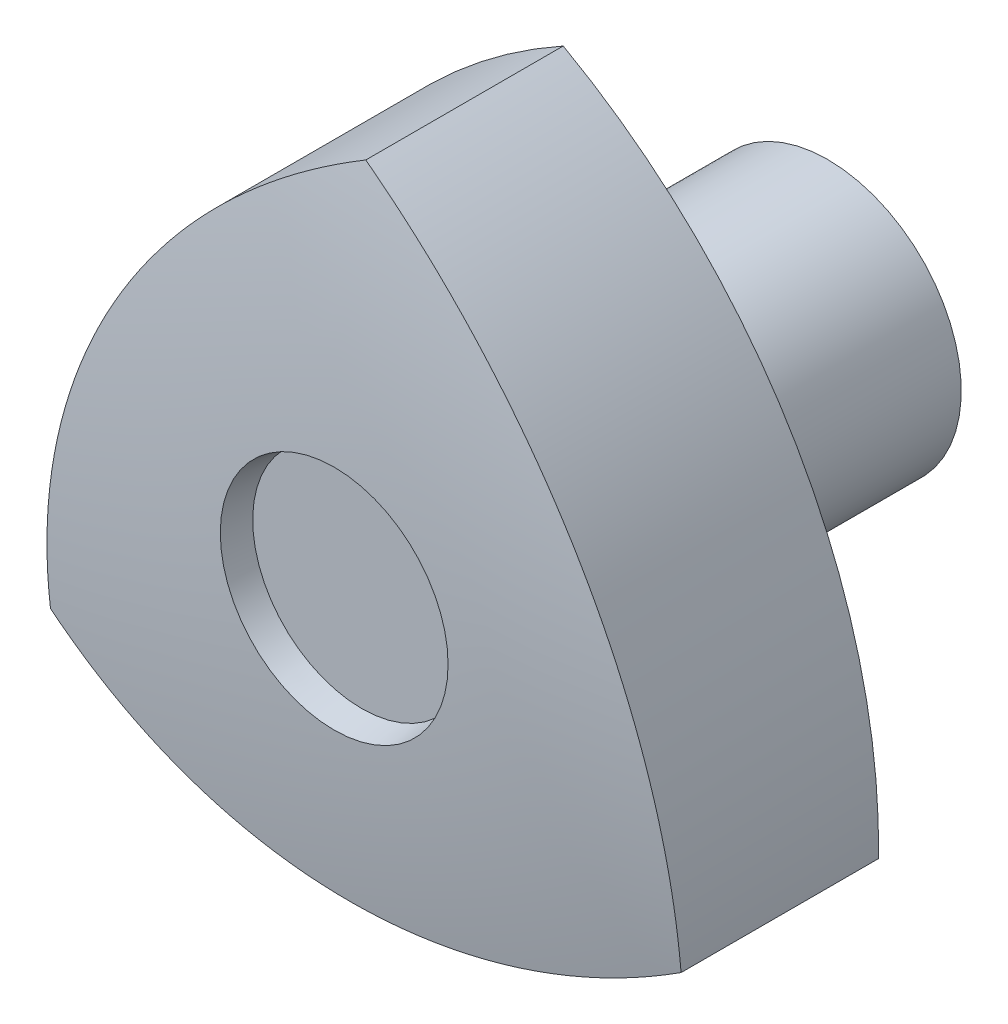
ISO-10303-21;
HEADER;
FILE_DESCRIPTION(('STEP AP214'),'2;1');
FILE_NAME('part.step','',(''),(''),'','','');
FILE_SCHEMA(('AUTOMOTIVE_DESIGN { 1 0 10303 214 1 1 1 1 }'));
ENDSEC;
DATA;
#1=APPLICATION_CONTEXT('core data for automotive mechanical design processes');
#2=APPLICATION_PROTOCOL_DEFINITION('international standard','automotive_design',2000,#1);
#3=PRODUCT_CONTEXT('',#1,'mechanical');
#4=PRODUCT('Part','Part','',(#3));
#5=PRODUCT_RELATED_PRODUCT_CATEGORY('part','',(#4));
#6=PRODUCT_DEFINITION_FORMATION('','',#4);
#7=PRODUCT_DEFINITION_CONTEXT('part definition',#1,'design');
#8=PRODUCT_DEFINITION('design','',#6,#7);
#9=PRODUCT_DEFINITION_SHAPE('','',#8);
#10=(LENGTH_UNIT() NAMED_UNIT(*) SI_UNIT(.MILLI.,.METRE.));
#11=(NAMED_UNIT(*) PLANE_ANGLE_UNIT() SI_UNIT($,.RADIAN.));
#12=(NAMED_UNIT(*) SI_UNIT($,.STERADIAN.) SOLID_ANGLE_UNIT());
#13=UNCERTAINTY_MEASURE_WITH_UNIT(LENGTH_MEASURE(1.E-05),#10,'distance_accuracy_value','');
#14=(GEOMETRIC_REPRESENTATION_CONTEXT(3) GLOBAL_UNCERTAINTY_ASSIGNED_CONTEXT((#13)) GLOBAL_UNIT_ASSIGNED_CONTEXT((#10,
#11,#12)) REPRESENTATION_CONTEXT('',''));
#15=CARTESIAN_POINT('',(0.,0.,0.));
#16=DIRECTION('',(0.,0.,1.));
#17=DIRECTION('',(1.,0.,0.));
#18=AXIS2_PLACEMENT_3D('',#15,#16,#17);
#19=CARTESIAN_POINT('',(0.,-4.99999999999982,0.));
#20=DIRECTION('',(0.,0.,1.));
#21=DIRECTION('',(0.,-1.,0.));
#22=AXIS2_PLACEMENT_3D('',#19,#20,#21);
#23=PLANE('',#22);
#24=CARTESIAN_POINT('',(0.,0.,0.));
#25=DIRECTION('',(0.,0.,-1.));
#26=DIRECTION('',(0.,1.,0.));
#27=AXIS2_PLACEMENT_3D('',#24,#25,#26);
#28=CIRCLE('',#27,5.);
#29=CARTESIAN_POINT('',(0.,5.,0.));
#30=VERTEX_POINT('',#29);
#31=EDGE_CURVE('E126',#30,#30,#28,.T.);
#32=ORIENTED_EDGE('',*,*,#31,.F.);
#33=EDGE_LOOP('',(#32));
#34=FACE_BOUND('',#33,.T.);
#35=CARTESIAN_POINT('',(0.,0.,0.));
#36=DIRECTION('',(0.,0.,-1.));
#37=DIRECTION('',(0.,1.,0.));
#38=AXIS2_PLACEMENT_3D('',#35,#36,#37);
#39=CIRCLE('',#38,6.49999999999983);
#40=CARTESIAN_POINT('',(0.,6.49999999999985,0.));
#41=VERTEX_POINT('',#40);
#42=EDGE_CURVE('E117',#41,#41,#39,.F.);
#43=ORIENTED_EDGE('',*,*,#42,.F.);
#44=EDGE_LOOP('',(#43));
#45=FACE_BOUND('',#44,.T.);
#46=ADVANCED_FACE('F14',(#34,#45),#23,.F.);
#47=CARTESIAN_POINT('',(0.,0.,38.6));
#48=DIRECTION('',(0.,0.,-1.));
#49=DIRECTION('',(0.,1.,0.));
#50=AXIS2_PLACEMENT_3D('',#47,#48,#49);
#51=CYLINDRICAL_SURFACE('',#50,6.49999999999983);
#52=ORIENTED_EDGE('',*,*,#42,.T.);
#53=EDGE_LOOP('',(#52));
#54=FACE_BOUND('',#53,.T.);
#55=CARTESIAN_POINT('',(0.,0.,0.200000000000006));
#56=DIRECTION('',(0.,0.,-1.));
#57=DIRECTION('',(0.,1.,0.));
#58=AXIS2_PLACEMENT_3D('',#55,#56,#57);
#59=CIRCLE('',#58,6.49999999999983);
#60=CARTESIAN_POINT('',(0.,6.49999999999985,0.200000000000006));
#61=VERTEX_POINT('',#60);
#62=EDGE_CURVE('E115',#61,#61,#59,.T.);
#63=ORIENTED_EDGE('',*,*,#62,.T.);
#64=EDGE_LOOP('',(#63));
#65=FACE_BOUND('',#64,.T.);
#66=ADVANCED_FACE('F166',(#54,#65),#51,.T.);
#67=CARTESIAN_POINT('',(0.,-6.49999999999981,0.199999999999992));
#68=DIRECTION('',(0.,0.,1.));
#69=DIRECTION('',(0.,-1.,0.));
#70=AXIS2_PLACEMENT_3D('',#67,#68,#69);
#71=PLANE('',#70);
#72=ORIENTED_EDGE('',*,*,#62,.F.);
#73=EDGE_LOOP('',(#72));
#74=FACE_BOUND('',#73,.T.);
#75=CARTESIAN_POINT('',(0.,0.,0.199999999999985));
#76=DIRECTION('',(0.,0.,-1.));
#77=DIRECTION('',(0.,1.,0.));
#78=AXIS2_PLACEMENT_3D('',#75,#76,#77);
#79=CIRCLE('',#78,11.);
#80=CARTESIAN_POINT('',(0.,11.,0.199999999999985));
#81=VERTEX_POINT('',#80);
#82=EDGE_CURVE('E112',#81,#81,#79,.F.);
#83=ORIENTED_EDGE('',*,*,#82,.F.);
#84=EDGE_LOOP('',(#83));
#85=FACE_BOUND('',#84,.T.);
#86=ADVANCED_FACE('F159',(#74,#85),#71,.F.);
#87=CARTESIAN_POINT('',(0.,0.,38.6));
#88=DIRECTION('',(0.,0.,-1.));
#89=DIRECTION('',(0.,1.,0.));
#90=AXIS2_PLACEMENT_3D('',#87,#88,#89);
#91=CYLINDRICAL_SURFACE('',#90,11.);
#92=ORIENTED_EDGE('',*,*,#82,.T.);
#93=EDGE_LOOP('',(#92));
#94=FACE_BOUND('',#93,.T.);
#95=CARTESIAN_POINT('',(0.,0.,22.));
#96=DIRECTION('',(0.,0.,-1.));
#97=DIRECTION('',(0.,1.,0.));
#98=AXIS2_PLACEMENT_3D('',#95,#96,#97);
#99=CIRCLE('',#98,11.);
#100=CARTESIAN_POINT('',(0.,11.,22.));
#101=VERTEX_POINT('',#100);
#102=EDGE_CURVE('E58',#101,#101,#99,.T.);
#103=ORIENTED_EDGE('',*,*,#102,.T.);
#104=EDGE_LOOP('',(#103));
#105=FACE_BOUND('',#104,.T.);
#106=ADVANCED_FACE('F154',(#94,#105),#91,.T.);
#107=CARTESIAN_POINT('',(0.,-11.,22.));
#108=DIRECTION('',(0.,0.,1.));
#109=DIRECTION('',(0.,-1.,0.));
#110=AXIS2_PLACEMENT_3D('',#107,#108,#109);
#111=PLANE('',#110);
#112=ORIENTED_EDGE('',*,*,#102,.F.);
#113=EDGE_LOOP('',(#112));
#114=FACE_BOUND('',#113,.T.);
#115=CARTESIAN_POINT('',(24.4868682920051,-14.1375,21.9999999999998));
#116=DIRECTION('',(0.,0.,1.));
#117=DIRECTION('',(-1.,0.,0.));
#118=AXIS2_PLACEMENT_3D('',#115,#116,#117);
#119=CIRCLE('',#118,50.475);
#120=CARTESIAN_POINT('',(-1.43982048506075E-13,30.,22.));
#121=VERTEX_POINT('',#120);
#122=CARTESIAN_POINT('',(-25.9807621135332,-14.9999999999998,22.));
#123=VERTEX_POINT('',#122);
#124=EDGE_CURVE('E62',#121,#123,#119,.T.);
#125=ORIENTED_EDGE('',*,*,#124,.F.);
#126=CARTESIAN_POINT('',(-24.486868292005,-14.1375,22.));
#127=DIRECTION('',(0.,0.,1.));
#128=DIRECTION('',(-1.,0.,0.));
#129=AXIS2_PLACEMENT_3D('',#126,#127,#128);
#130=CIRCLE('',#129,50.475);
#131=CARTESIAN_POINT('',(25.9807621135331,-15.0000000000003,22.));
#132=VERTEX_POINT('',#131);
#133=EDGE_CURVE('E60',#132,#121,#130,.T.);
#134=ORIENTED_EDGE('',*,*,#133,.F.);
#135=CARTESIAN_POINT('',(0.,28.275,22.));
#136=DIRECTION('',(0.,0.,1.));
#137=DIRECTION('',(-1.,0.,0.));
#138=AXIS2_PLACEMENT_3D('',#135,#136,#137);
#139=CIRCLE('',#138,50.475);
#140=EDGE_CURVE('E49',#123,#132,#139,.T.);
#141=ORIENTED_EDGE('',*,*,#140,.F.);
#142=EDGE_LOOP('',(#125,#134,#141));
#143=FACE_BOUND('',#142,.T.);
#144=ADVANCED_FACE('F61',(#114,#143),#111,.F.);
#145=CARTESIAN_POINT('',(0.,-8.98498976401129,38.6));
#146=DIRECTION('',(0.,0.,-1.));
#147=DIRECTION('',(0.,1.,0.));
#148=AXIS2_PLACEMENT_3D('',#145,#146,#147);
#149=PLANE('',#148);
#150=CARTESIAN_POINT('',(0.,0.,38.6));
#151=DIRECTION('',(0.,0.,1.));
#152=DIRECTION('',(0.,-1.,0.));
#153=AXIS2_PLACEMENT_3D('',#150,#151,#152);
#154=CIRCLE('',#153,8.98498976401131);
#155=CARTESIAN_POINT('',(0.,-8.98498976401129,38.6));
#156=VERTEX_POINT('',#155);
#157=EDGE_CURVE('E106',#156,#156,#154,.T.);
#158=ORIENTED_EDGE('',*,*,#157,.T.);
#159=EDGE_LOOP('',(#158));
#160=FACE_BOUND('',#159,.T.);
#161=ADVANCED_FACE('F98',(#160),#149,.F.);
#162=CARTESIAN_POINT('',(0.,28.275,60.));
#163=DIRECTION('',(0.,0.,1.));
#164=DIRECTION('',(-1.,0.,0.));
#165=AXIS2_PLACEMENT_3D('',#162,#163,#164);
#166=CYLINDRICAL_SURFACE('',#165,50.475);
#167=CARTESIAN_POINT('',(-25.9807621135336,-15.,38.2666666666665));
#168=CARTESIAN_POINT('',(-25.4333646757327,-15.3286377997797,38.3303674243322));
#169=CARTESIAN_POINT('',(-24.8796016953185,-15.6469655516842,38.3919197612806));
#170=CARTESIAN_POINT('',(-23.7600350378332,-16.2625632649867,38.5106833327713));
#171=CARTESIAN_POINT('',(-23.1942313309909,-16.5598331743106,38.5678945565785));
#172=CARTESIAN_POINT('',(-21.4800854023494,-17.4192535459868,38.7329221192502));
#173=CARTESIAN_POINT('',(-20.314733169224,-17.949179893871,38.8341643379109));
#174=CARTESIAN_POINT('',(-17.9460386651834,-18.9193184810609,39.0187399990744));
#175=CARTESIAN_POINT('',(-16.7426967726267,-19.3595316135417,39.1020736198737));
#176=CARTESIAN_POINT('',(-14.3049330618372,-20.1474680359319,39.2506711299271));
#177=CARTESIAN_POINT('',(-13.0705096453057,-20.4951865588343,39.3159340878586));
#178=CARTESIAN_POINT('',(-10.4610806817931,-21.1239590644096,39.4335816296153));
#179=CARTESIAN_POINT('',(-9.08374319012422,-21.3957097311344,39.4841857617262));
#180=CARTESIAN_POINT('',(-6.31052709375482,-21.8236189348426,39.5636971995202));
#181=CARTESIAN_POINT('',(-4.91464705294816,-21.9797684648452,39.5926028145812));
#182=CARTESIAN_POINT('',(-2.11416082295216,-22.1752381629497,39.6287660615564));
#183=CARTESIAN_POINT('',(-0.709552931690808,-22.2145347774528,39.6360193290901));
#184=CARTESIAN_POINT('',(2.09792344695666,-22.1759176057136,39.6288830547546));
#185=CARTESIAN_POINT('',(3.50079202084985,-22.0980099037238,39.6144946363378));
#186=CARTESIAN_POINT('',(6.28771921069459,-21.8263032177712,39.5641714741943));
#187=CARTESIAN_POINT('',(7.67183699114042,-21.6330902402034,39.5283456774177));
#188=CARTESIAN_POINT('',(10.4187751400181,-21.1327305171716,39.4351850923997));
#189=CARTESIAN_POINT('',(11.7815929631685,-20.8255702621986,39.3778477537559));
#190=CARTESIAN_POINT('',(14.4745364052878,-20.1001609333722,39.241761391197));
#191=CARTESIAN_POINT('',(15.8046966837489,-19.6820357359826,39.1630362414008));
#192=CARTESIAN_POINT('',(18.4242372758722,-18.7378678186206,38.9843019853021));
#193=CARTESIAN_POINT('',(19.7136361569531,-18.2118750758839,38.8843027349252));
#194=CARTESIAN_POINT('',(21.4075776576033,-17.4378499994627,38.7363291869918));
#195=CARTESIAN_POINT('',(21.8342926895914,-17.235573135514,38.697594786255));
#196=CARTESIAN_POINT('',(22.6816334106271,-16.8192546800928,38.6177315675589));
#197=CARTESIAN_POINT('',(23.1022604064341,-16.6052156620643,38.5766032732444));
#198=CARTESIAN_POINT('',(23.9363879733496,-16.1659355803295,38.4920437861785));
#199=CARTESIAN_POINT('',(24.3499001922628,-15.9407157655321,38.448616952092));
#200=CARTESIAN_POINT('',(25.1703585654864,-15.4788612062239,38.3594040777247));
#201=CARTESIAN_POINT('',(25.5773033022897,-15.2422240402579,38.3136175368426));
#202=CARTESIAN_POINT('',(25.980762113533,-15.0000000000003,38.2666666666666));
#203=B_SPLINE_CURVE_WITH_KNOTS('',3,(#167,#168,#169,#170,#171,#172,#173,#174,#175,#176,#177,
#178,#179,#180,#181,#182,#183,#184,#185,#186,#187,#188,#189,#190,#191,#192,#193,#194,#195,#196,
#197,#198,#199,#200,#201,#202),.UNSPECIFIED.,.F.,.F.,(4,2,2,2,2,2,2,2,2,2,2,2,2,2,2,2,2,4),(0.,
1.92468080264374,3.8493663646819,7.69777230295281,11.5461399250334,15.3947058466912,
19.6039988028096,23.8136196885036,28.0240890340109,32.2343398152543,36.4233732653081,
40.6129035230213,44.7977763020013,48.9807145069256,50.402040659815,51.8230570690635,
53.241469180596,54.6601834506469),.UNSPECIFIED.);
#204=CARTESIAN_POINT('',(-25.9807621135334,-14.9999999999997,38.2666666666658));
#205=VERTEX_POINT('',#204);
#206=CARTESIAN_POINT('',(25.9807621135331,-15.0000000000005,38.2666666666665));
#207=VERTEX_POINT('',#206);
#208=EDGE_CURVE('E100',#205,#207,#203,.T.);
#209=ORIENTED_EDGE('',*,*,#208,.F.);
#210=DIRECTION('',(0.,0.,1.));
#211=VECTOR('',#210,1.);
#212=CARTESIAN_POINT('',(-25.9807621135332,-14.9999999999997,60.));
#213=LINE('',#212,#211);
#214=EDGE_CURVE('E56',#123,#205,#213,.T.);
#215=ORIENTED_EDGE('',*,*,#214,.F.);
#216=ORIENTED_EDGE('',*,*,#140,.T.);
#217=DIRECTION('',(0.,0.,1.));
#218=VECTOR('',#217,1.);
#219=CARTESIAN_POINT('',(25.9807621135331,-15.0000000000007,60.));
#220=LINE('',#219,#218);
#221=EDGE_CURVE('E54',#207,#132,#220,.F.);
#222=ORIENTED_EDGE('',*,*,#221,.F.);
#223=EDGE_LOOP('',(#209,#215,#216,#222));
#224=FACE_BOUND('',#223,.T.);
#225=ADVANCED_FACE('F52',(#224),#166,.T.);
#226=CARTESIAN_POINT('',(-24.486868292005,-14.1375000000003,60.));
#227=DIRECTION('',(0.,0.,1.));
#228=DIRECTION('',(-1.,0.,0.));
#229=AXIS2_PLACEMENT_3D('',#226,#227,#228);
#230=CYLINDRICAL_SURFACE('',#229,50.475);
#231=ORIENTED_EDGE('',*,*,#221,.T.);
#232=ORIENTED_EDGE('',*,*,#133,.T.);
#233=DIRECTION('',(0.,0.,1.));
#234=VECTOR('',#233,1.);
#235=CARTESIAN_POINT('',(-2.32452945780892E-13,29.9999999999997,60.));
#236=LINE('',#235,#234);
#237=CARTESIAN_POINT('',(-3.47211615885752E-13,30.,38.2666666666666));
#238=VERTEX_POINT('',#237);
#239=EDGE_CURVE('E34',#238,#121,#236,.F.);
#240=ORIENTED_EDGE('',*,*,#239,.F.);
#241=CARTESIAN_POINT('',(25.9807621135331,-15.0000000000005,38.2666666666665));
#242=CARTESIAN_POINT('',(25.9916720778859,-14.3616210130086,38.3303674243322));
#243=CARTESIAN_POINT('',(25.9904705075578,-13.7228843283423,38.3919197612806));
#244=CARTESIAN_POINT('',(25.9638104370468,-12.4455123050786,38.5106833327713));
#245=CARTESIAN_POINT('',(25.9383518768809,-11.8068769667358,38.5678945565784));
#246=CARTESIAN_POINT('',(25.8255587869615,-9.89267286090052,38.7329221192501));
#247=CARTESIAN_POINT('',(25.7018123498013,-8.61848504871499,38.8341643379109));
#248=CARTESIAN_POINT('',(25.3576297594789,-6.08206614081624,39.0187399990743));
#249=CARTESIAN_POINT('',(25.1371945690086,-4.81983492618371,39.1020736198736));
#250=CARTESIAN_POINT('',(24.6006856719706,-2.31470141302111,39.250671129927));
#251=CARTESIAN_POINT('',(24.2846070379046,-1.07180011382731,39.3159340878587));
#252=CARTESIAN_POINT('',(23.5244255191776,1.50241791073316,39.4335816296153));
#253=CARTESIAN_POINT('',(23.0710997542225,2.83110250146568,39.4841857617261));
#254=CARTESIAN_POINT('',(22.0550719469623,5.44673269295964,39.5636971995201));
#255=CARTESIAN_POINT('',(21.4923613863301,6.73367503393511,39.5926028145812));
#256=CARTESIAN_POINT('',(20.2613999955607,9.25670210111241,39.6287660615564));
#257=CARTESIAN_POINT('',(19.5931279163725,10.4927765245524,39.6360193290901));
#258=CARTESIAN_POINT('',(18.1559462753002,12.9048138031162,39.6288830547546));
#259=CARTESIAN_POINT('',(17.3870419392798,14.0807797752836,39.6144946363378));
#260=CARTESIAN_POINT('',(15.7582734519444,16.3584761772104,39.5641714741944));
#261=CARTESIAN_POINT('',(14.8988872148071,17.4605508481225,39.5283456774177));
#262=CARTESIAN_POINT('',(13.0920939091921,19.5892892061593,39.4351850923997));
#263=CARTESIAN_POINT('',(12.1446764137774,20.6159439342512,39.377847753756));
#264=CARTESIAN_POINT('',(10.1699817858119,22.585396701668,39.241761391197));
#265=CARTESIAN_POINT('',(9.14279460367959,23.5282866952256,39.1630362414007));
#266=CARTESIAN_POINT('',(7.01535090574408,25.3247914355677,38.9843019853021));
#267=CARTESIAN_POINT('',(5.91512838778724,26.1784472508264,38.8843027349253));
#268=CARTESIAN_POINT('',(4.39783225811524,27.2584310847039,38.7363291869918));
#269=CARTESIAN_POINT('',(4.00929783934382,27.5268387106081,38.697594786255));
#270=CARTESIAN_POINT('',(3.22508512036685,28.0524980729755,38.6177315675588));
#271=CARTESIAN_POINT('',(2.82940839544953,28.3097522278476,38.5766032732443));
#272=CARTESIAN_POINT('',(2.03191690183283,28.812487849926,38.4920437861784));
#273=CARTESIAN_POINT('',(1.63011471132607,29.0579900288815,38.448616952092));
#274=CARTESIAN_POINT('',(0.819907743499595,29.5376005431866,38.3594040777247));
#275=CARTESIAN_POINT('',(0.411501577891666,29.7717064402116,38.3136175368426));
#276=CARTESIAN_POINT('',(-5.37901856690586E-13,30.,38.2666666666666));
#277=B_SPLINE_CURVE_WITH_KNOTS('',3,(#241,#242,#243,#244,#245,#246,#247,#248,#249,#250,#251,
#252,#253,#254,#255,#256,#257,#258,#259,#260,#261,#262,#263,#264,#265,#266,#267,#268,#269,#270,
#271,#272,#273,#274,#275,#276),.UNSPECIFIED.,.F.,.F.,(4,2,2,2,2,2,2,2,2,2,2,2,2,2,2,2,2,4),(0.,
1.92468080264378,3.84936636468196,7.69777230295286,11.5461399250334,15.3947058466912,
19.6039988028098,23.8136196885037,28.024089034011,32.2343398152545,36.4233732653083,
40.6129035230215,44.7977763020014,48.9807145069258,50.4020406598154,51.823057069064,
53.2414691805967,54.6601834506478),.UNSPECIFIED.);
#278=EDGE_CURVE('E66',#207,#238,#277,.T.);
#279=ORIENTED_EDGE('',*,*,#278,.F.);
#280=EDGE_LOOP('',(#231,#232,#240,#279));
#281=FACE_BOUND('',#280,.T.);
#282=ADVANCED_FACE('F64',(#281),#230,.T.);
#283=CARTESIAN_POINT('',(24.4868682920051,-14.1375000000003,60.));
#284=DIRECTION('',(0.,0.,1.));
#285=DIRECTION('',(-1.,0.,0.));
#286=AXIS2_PLACEMENT_3D('',#283,#284,#285);
#287=CYLINDRICAL_SURFACE('',#286,50.475);
#288=ORIENTED_EDGE('',*,*,#239,.T.);
#289=ORIENTED_EDGE('',*,*,#124,.T.);
#290=ORIENTED_EDGE('',*,*,#214,.T.);
#291=CARTESIAN_POINT('',(-4.61208800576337E-13,29.9999999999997,38.2666666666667));
#292=CARTESIAN_POINT('',(-0.558307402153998,29.6902588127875,38.3303674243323));
#293=CARTESIAN_POINT('',(-1.11086881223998,29.3698498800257,38.3919197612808));
#294=CARTESIAN_POINT('',(-2.20377539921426,28.7080755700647,38.5106833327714));
#295=CARTESIAN_POINT('',(-2.7441205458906,28.3667101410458,38.5678945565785));
#296=CARTESIAN_POINT('',(-4.34547338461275,27.3119264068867,38.7329221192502));
#297=CARTESIAN_POINT('',(-5.38707918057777,26.5676649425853,38.834164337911));
#298=CARTESIAN_POINT('',(-7.41159109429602,25.0013846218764,39.0187399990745));
#299=CARTESIAN_POINT('',(-8.39449779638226,24.1793665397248,39.1020736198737));
#300=CARTESIAN_POINT('',(-10.2957526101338,22.4621694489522,39.2506711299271));
#301=CARTESIAN_POINT('',(-11.2140973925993,21.5669866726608,39.3159340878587));
#302=CARTESIAN_POINT('',(-13.063344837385,19.6215411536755,39.4335816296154));
#303=CARTESIAN_POINT('',(-13.9873565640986,18.564607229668,39.4841857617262));
#304=CARTESIAN_POINT('',(-15.7445448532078,16.3768862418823,39.5636971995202));
#305=CARTESIAN_POINT('',(-16.5777143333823,15.2460934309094,39.5926028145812));
#306=CARTESIAN_POINT('',(-18.1472391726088,12.9185360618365,39.6287660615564));
#307=CARTESIAN_POINT('',(-18.883574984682,11.7217582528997,39.6360193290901));
#308=CARTESIAN_POINT('',(-20.2538697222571,9.27110380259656,39.6288830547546));
#309=CARTESIAN_POINT('',(-20.88783396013,8.01723012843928,39.6144946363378));
#310=CARTESIAN_POINT('',(-22.0459926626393,5.46782704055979,39.5641714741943));
#311=CARTESIAN_POINT('',(-22.5707242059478,4.17253939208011,39.5283456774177));
#312=CARTESIAN_POINT('',(-23.5108690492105,1.54344131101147,39.4351850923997));
#313=CARTESIAN_POINT('',(-23.9262693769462,0.209626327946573,39.3778477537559));
#314=CARTESIAN_POINT('',(-24.6445181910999,-2.48523576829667,39.2417613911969));
#315=CARTESIAN_POINT('',(-24.9474912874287,-3.84625095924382,39.1630362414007));
#316=CARTESIAN_POINT('',(-25.4395881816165,-6.58692361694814,38.984301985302));
#317=CARTESIAN_POINT('',(-25.6287645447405,-7.96657217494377,38.8843027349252));
#318=CARTESIAN_POINT('',(-25.8054099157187,-9.82058108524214,38.7363291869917));
#319=CARTESIAN_POINT('',(-25.8435905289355,-10.2912655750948,38.6975947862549));
#320=CARTESIAN_POINT('',(-25.9067185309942,-11.2332433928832,38.6177315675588));
#321=CARTESIAN_POINT('',(-25.931668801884,-11.7045365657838,38.5766032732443));
#322=CARTESIAN_POINT('',(-25.9683048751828,-12.6465522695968,38.4920437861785));
#323=CARTESIAN_POINT('',(-25.9800149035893,-13.1172742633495,38.448616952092));
#324=CARTESIAN_POINT('',(-25.9902663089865,-14.0587393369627,38.3594040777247));
#325=CARTESIAN_POINT('',(-25.988804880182,-14.5294823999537,38.3136175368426));
#326=CARTESIAN_POINT('',(-25.9807621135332,-14.9999999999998,38.2666666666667));
#327=B_SPLINE_CURVE_WITH_KNOTS('',3,(#291,#292,#293,#294,#295,#296,#297,#298,#299,#300,#301,
#302,#303,#304,#305,#306,#307,#308,#309,#310,#311,#312,#313,#314,#315,#316,#317,#318,#319,#320,
#321,#322,#323,#324,#325,#326),.UNSPECIFIED.,.F.,.F.,(4,2,2,2,2,2,2,2,2,2,2,2,2,2,2,2,2,4),(0.,
1.92468080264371,3.84936636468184,7.69777230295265,11.5461399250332,15.3947058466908,
19.6039988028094,23.8136196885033,28.0240890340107,32.2343398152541,36.4233732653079,
40.6129035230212,44.7977763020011,48.9807145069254,50.4020406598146,51.8230570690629,
53.2414691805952,54.6601834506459),.UNSPECIFIED.);
#328=EDGE_CURVE('E25',#238,#205,#327,.T.);
#329=ORIENTED_EDGE('',*,*,#328,.F.);
#330=EDGE_LOOP('',(#288,#289,#290,#329));
#331=FACE_BOUND('',#330,.T.);
#332=ADVANCED_FACE('F85',(#331),#287,.T.);
#333=CARTESIAN_POINT('',(0.,0.,40.8712829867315));
#334=DIRECTION('',(0.,0.,1.));
#335=DIRECTION('',(0.,-1.,0.));
#336=AXIS2_PLACEMENT_3D('',#333,#334,#335);
#337=CONICAL_SURFACE('',#336,9.38547823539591,0.174532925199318);
#338=CARTESIAN_POINT('',(0.,0.,40.8712829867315));
#339=DIRECTION('',(0.,0.,-1.));
#340=DIRECTION('',(0.,1.,0.));
#341=AXIS2_PLACEMENT_3D('',#338,#339,#340);
#342=CIRCLE('',#341,9.38547823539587);
#343=CARTESIAN_POINT('',(0.,9.38547823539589,40.8712829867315));
#344=VERTEX_POINT('',#343);
#345=EDGE_CURVE('E9',#344,#344,#342,.T.);
#346=ORIENTED_EDGE('',*,*,#345,.F.);
#347=EDGE_LOOP('',(#346));
#348=FACE_BOUND('',#347,.T.);
#349=ORIENTED_EDGE('',*,*,#157,.F.);
#350=EDGE_LOOP('',(#349));
#351=FACE_BOUND('',#350,.T.);
#352=ADVANCED_FACE('F89',(#348,#351),#337,.F.);
#353=CARTESIAN_POINT('',(0.,0.,-93.7719850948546));
#354=DIRECTION('',(0.,0.,1.));
#355=DIRECTION('',(0.,-1.,0.));
#356=AXIS2_PLACEMENT_3D('',#353,#354,#355);
#357=DEGENERATE_TOROIDAL_SURFACE('',#356,2.84529320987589,134.802016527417,.T.);
#358=ORIENTED_EDGE('',*,*,#345,.T.);
#359=EDGE_LOOP('',(#358));
#360=FACE_BOUND('',#359,.T.);
#361=ORIENTED_EDGE('',*,*,#278,.T.);
#362=ORIENTED_EDGE('',*,*,#328,.T.);
#363=ORIENTED_EDGE('',*,*,#208,.T.);
#364=EDGE_LOOP('',(#361,#362,#363));
#365=FACE_BOUND('',#364,.T.);
#366=ADVANCED_FACE('F16',(#360,#365),#357,.T.);
#367=CARTESIAN_POINT('',(0.,0.,16.));
#368=DIRECTION('',(0.,0.,-1.));
#369=DIRECTION('',(0.,1.,0.));
#370=AXIS2_PLACEMENT_3D('',#367,#368,#369);
#371=CYLINDRICAL_SURFACE('',#370,5.);
#372=CARTESIAN_POINT('',(0.,0.,16.));
#373=DIRECTION('',(0.,0.,-1.));
#374=DIRECTION('',(0.,1.,0.));
#375=AXIS2_PLACEMENT_3D('',#372,#373,#374);
#376=CIRCLE('',#375,5.);
#377=CARTESIAN_POINT('',(0.,5.,16.));
#378=VERTEX_POINT('',#377);
#379=EDGE_CURVE('E122',#378,#378,#376,.T.);
#380=ORIENTED_EDGE('',*,*,#379,.F.);
#381=EDGE_LOOP('',(#380));
#382=FACE_BOUND('',#381,.T.);
#383=ORIENTED_EDGE('',*,*,#31,.T.);
#384=EDGE_LOOP('',(#383));
#385=FACE_BOUND('',#384,.T.);
#386=ADVANCED_FACE('F136',(#382,#385),#371,.F.);
#387=CARTESIAN_POINT('',(0.,0.,37.));
#388=DIRECTION('',(0.,0.,1.));
#389=DIRECTION('',(0.,-1.,0.));
#390=AXIS2_PLACEMENT_3D('',#387,#388,#389);
#391=PLANE('',#390);
#392=CARTESIAN_POINT('',(0.,0.,37.));
#393=DIRECTION('',(0.,0.,1.));
#394=DIRECTION('',(0.,-1.,0.));
#395=AXIS2_PLACEMENT_3D('',#392,#393,#394);
#396=CIRCLE('',#395,8.70286659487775);
#397=CARTESIAN_POINT('',(0.,-8.70286659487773,37.));
#398=VERTEX_POINT('',#397);
#399=EDGE_CURVE('E19',#398,#398,#396,.F.);
#400=ORIENTED_EDGE('',*,*,#399,.T.);
#401=EDGE_LOOP('',(#400));
#402=FACE_BOUND('',#401,.T.);
#403=ADVANCED_FACE('F143',(#402),#391,.F.);
#404=CARTESIAN_POINT('',(0.,0.,37.));
#405=DIRECTION('',(0.,0.,1.));
#406=DIRECTION('',(0.,-1.,0.));
#407=AXIS2_PLACEMENT_3D('',#404,#405,#406);
#408=CONICAL_SURFACE('',#407,8.70286659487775,0.174532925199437);
#409=ORIENTED_EDGE('',*,*,#399,.F.);
#410=EDGE_LOOP('',(#409));
#411=FACE_BOUND('',#410,.T.);
#412=ORIENTED_EDGE('',*,*,#379,.T.);
#413=EDGE_LOOP('',(#412));
#414=FACE_BOUND('',#413,.T.);
#415=ADVANCED_FACE('F173',(#411,#414),#408,.F.);
#416=CLOSED_SHELL('',(#46,#66,#86,#106,#144,#161,#225,#282,#332,#352,#366,#386,#403,#415));
#417=MANIFOLD_SOLID_BREP('B1',#416);
#418=ADVANCED_BREP_SHAPE_REPRESENTATION('',(#18,#417),#14);
#419=SHAPE_DEFINITION_REPRESENTATION(#9,#418);
ENDSEC;
END-ISO-10303-21;
